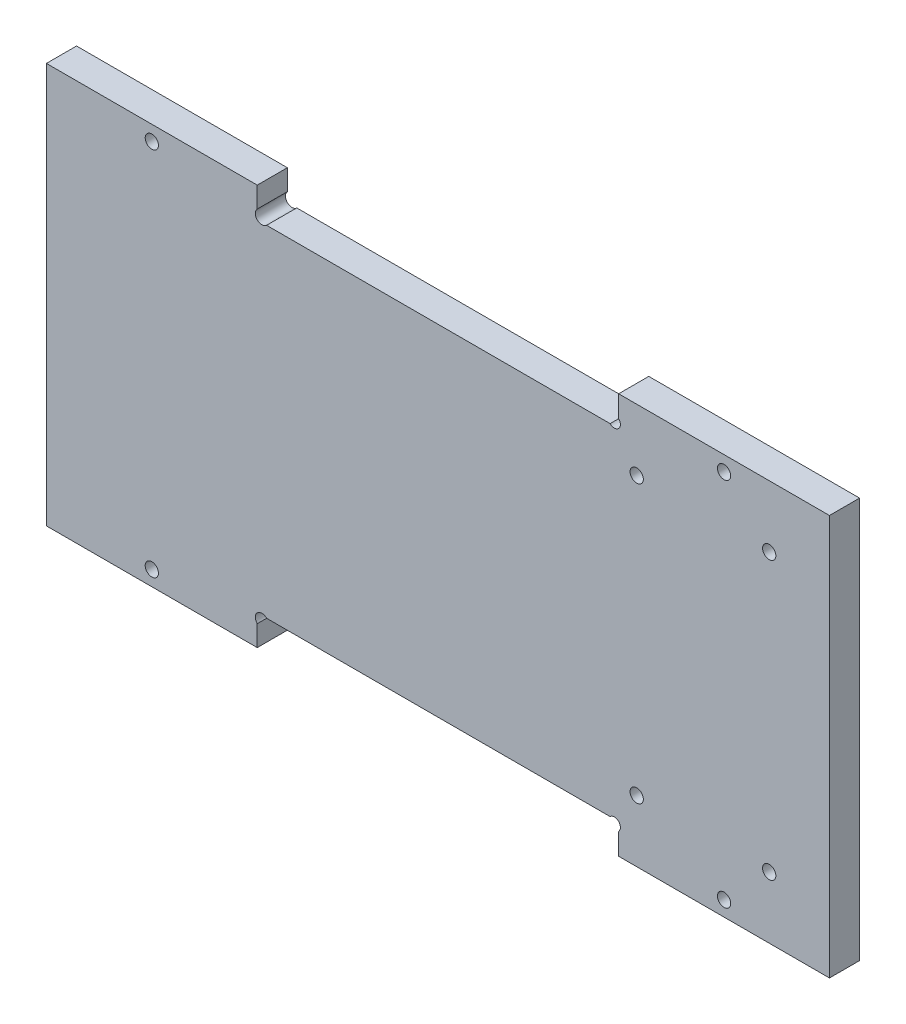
ISO-10303-21;
HEADER;
FILE_DESCRIPTION(('STEP AP214'),'2;1');
FILE_NAME('part.step','',(''),(''),'','','');
FILE_SCHEMA(('AUTOMOTIVE_DESIGN { 1 0 10303 214 1 1 1 1 }'));
ENDSEC;
DATA;
#1=APPLICATION_CONTEXT('core data for automotive mechanical design processes');
#2=APPLICATION_PROTOCOL_DEFINITION('international standard','automotive_design',2000,#1);
#3=PRODUCT_CONTEXT('',#1,'mechanical');
#4=PRODUCT('Part','Part','',(#3));
#5=PRODUCT_RELATED_PRODUCT_CATEGORY('part','',(#4));
#6=PRODUCT_DEFINITION_FORMATION('','',#4);
#7=PRODUCT_DEFINITION_CONTEXT('part definition',#1,'design');
#8=PRODUCT_DEFINITION('design','',#6,#7);
#9=PRODUCT_DEFINITION_SHAPE('','',#8);
#10=(LENGTH_UNIT() NAMED_UNIT(*) SI_UNIT(.MILLI.,.METRE.));
#11=(NAMED_UNIT(*) PLANE_ANGLE_UNIT() SI_UNIT($,.RADIAN.));
#12=(NAMED_UNIT(*) SI_UNIT($,.STERADIAN.) SOLID_ANGLE_UNIT());
#13=UNCERTAINTY_MEASURE_WITH_UNIT(LENGTH_MEASURE(1.E-05),#10,'distance_accuracy_value','');
#14=(GEOMETRIC_REPRESENTATION_CONTEXT(3) GLOBAL_UNCERTAINTY_ASSIGNED_CONTEXT((#13)) GLOBAL_UNIT_ASSIGNED_CONTEXT((#10,
#11,#12)) REPRESENTATION_CONTEXT('',''));
#15=CARTESIAN_POINT('',(0.,0.,0.));
#16=DIRECTION('',(0.,0.,1.));
#17=DIRECTION('',(1.,0.,0.));
#18=AXIS2_PLACEMENT_3D('',#15,#16,#17);
#19=CARTESIAN_POINT('',(0.,66.5,5.));
#20=DIRECTION('',(0.,0.,-1.));
#21=DIRECTION('',(-1.,0.,0.));
#22=AXIS2_PLACEMENT_3D('',#19,#20,#21);
#23=PLANE('',#22);
#24=CARTESIAN_POINT('',(17.5,2.5,5.));
#25=DIRECTION('',(0.,0.,-1.));
#26=DIRECTION('',(-1.,0.,0.));
#27=AXIS2_PLACEMENT_3D('',#24,#25,#26);
#28=CIRCLE('',#27,1.10000000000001);
#29=CARTESIAN_POINT('',(16.4,2.5,5.));
#30=VERTEX_POINT('',#29);
#31=EDGE_CURVE('E352',#30,#30,#28,.T.);
#32=ORIENTED_EDGE('',*,*,#31,.T.);
#33=EDGE_LOOP('',(#32));
#34=FACE_BOUND('',#33,.T.);
#35=CARTESIAN_POINT('',(112.5,2.5,5.));
#36=DIRECTION('',(0.,0.,-1.));
#37=DIRECTION('',(-1.,0.,0.));
#38=AXIS2_PLACEMENT_3D('',#35,#36,#37);
#39=CIRCLE('',#38,1.10000000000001);
#40=CARTESIAN_POINT('',(111.4,2.5,5.));
#41=VERTEX_POINT('',#40);
#42=EDGE_CURVE('E169',#41,#41,#39,.F.);
#43=ORIENTED_EDGE('',*,*,#42,.F.);
#44=EDGE_LOOP('',(#43));
#45=FACE_BOUND('',#44,.T.);
#46=CARTESIAN_POINT('',(120.,56.25,5.));
#47=DIRECTION('',(0.,0.,1.));
#48=DIRECTION('',(1.,0.,0.));
#49=AXIS2_PLACEMENT_3D('',#46,#47,#48);
#50=CIRCLE('',#49,1.09999999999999);
#51=CARTESIAN_POINT('',(121.1,56.25,5.));
#52=VERTEX_POINT('',#51);
#53=EDGE_CURVE('E243',#52,#52,#50,.T.);
#54=ORIENTED_EDGE('',*,*,#53,.F.);
#55=EDGE_LOOP('',(#54));
#56=FACE_BOUND('',#55,.T.);
#57=CARTESIAN_POINT('',(120.,10.25,5.));
#58=DIRECTION('',(0.,0.,1.));
#59=DIRECTION('',(1.,0.,0.));
#60=AXIS2_PLACEMENT_3D('',#57,#58,#59);
#61=CIRCLE('',#60,1.09999999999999);
#62=CARTESIAN_POINT('',(121.1,10.25,5.));
#63=VERTEX_POINT('',#62);
#64=EDGE_CURVE('E237',#63,#63,#61,.T.);
#65=ORIENTED_EDGE('',*,*,#64,.F.);
#66=EDGE_LOOP('',(#65));
#67=FACE_BOUND('',#66,.T.);
#68=CARTESIAN_POINT('',(98.,10.25,5.));
#69=DIRECTION('',(0.,0.,1.));
#70=DIRECTION('',(1.,0.,0.));
#71=AXIS2_PLACEMENT_3D('',#68,#69,#70);
#72=CIRCLE('',#71,1.10000000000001);
#73=CARTESIAN_POINT('',(99.1,10.25,5.));
#74=VERTEX_POINT('',#73);
#75=EDGE_CURVE('E231',#74,#74,#72,.T.);
#76=ORIENTED_EDGE('',*,*,#75,.F.);
#77=EDGE_LOOP('',(#76));
#78=FACE_BOUND('',#77,.T.);
#79=CARTESIAN_POINT('',(98.,56.25,5.));
#80=DIRECTION('',(0.,0.,1.));
#81=DIRECTION('',(1.,0.,0.));
#82=AXIS2_PLACEMENT_3D('',#79,#80,#81);
#83=CIRCLE('',#82,1.10000000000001);
#84=CARTESIAN_POINT('',(99.1,56.25,5.));
#85=VERTEX_POINT('',#84);
#86=EDGE_CURVE('E225',#85,#85,#83,.T.);
#87=ORIENTED_EDGE('',*,*,#86,.F.);
#88=EDGE_LOOP('',(#87));
#89=FACE_BOUND('',#88,.T.);
#90=CARTESIAN_POINT('',(35.7778174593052,62.2778174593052,5.));
#91=DIRECTION('',(0.,0.,-1.));
#92=DIRECTION('',(-1.,0.,0.));
#93=AXIS2_PLACEMENT_3D('',#90,#91,#92);
#94=CIRCLE('',#93,1.1);
#95=CARTESIAN_POINT('',(36.5556349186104,61.5,5.));
#96=VERTEX_POINT('',#95);
#97=CARTESIAN_POINT('',(35.,63.0556349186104,5.));
#98=VERTEX_POINT('',#97);
#99=EDGE_CURVE('E160',#96,#98,#94,.T.);
#100=ORIENTED_EDGE('',*,*,#99,.T.);
#101=DIRECTION('',(0.,1.,0.));
#102=VECTOR('',#101,1.);
#103=CARTESIAN_POINT('',(35.,66.5,5.));
#104=LINE('',#103,#102);
#105=CARTESIAN_POINT('',(35.,66.5,5.));
#106=VERTEX_POINT('',#105);
#107=EDGE_CURVE('E167',#98,#106,#104,.T.);
#108=ORIENTED_EDGE('',*,*,#107,.T.);
#109=DIRECTION('',(-1.,0.,0.));
#110=VECTOR('',#109,1.);
#111=CARTESIAN_POINT('',(0.,66.5,5.));
#112=LINE('',#111,#110);
#113=CARTESIAN_POINT('',(0.,66.5,5.));
#114=VERTEX_POINT('',#113);
#115=EDGE_CURVE('E259',#106,#114,#112,.T.);
#116=ORIENTED_EDGE('',*,*,#115,.T.);
#117=DIRECTION('',(0.,-1.,0.));
#118=VECTOR('',#117,1.);
#119=CARTESIAN_POINT('',(0.,0.,5.));
#120=LINE('',#119,#118);
#121=CARTESIAN_POINT('',(0.,0.,5.));
#122=VERTEX_POINT('',#121);
#123=EDGE_CURVE('E249',#114,#122,#120,.T.);
#124=ORIENTED_EDGE('',*,*,#123,.T.);
#125=DIRECTION('',(1.,0.,0.));
#126=VECTOR('',#125,1.);
#127=CARTESIAN_POINT('',(0.,0.,5.));
#128=LINE('',#127,#126);
#129=CARTESIAN_POINT('',(35.,0.,5.));
#130=VERTEX_POINT('',#129);
#131=EDGE_CURVE('E254',#122,#130,#128,.T.);
#132=ORIENTED_EDGE('',*,*,#131,.T.);
#133=DIRECTION('',(0.,-1.,0.));
#134=VECTOR('',#133,1.);
#135=CARTESIAN_POINT('',(35.,0.,5.));
#136=LINE('',#135,#134);
#137=CARTESIAN_POINT('',(35.,3.44436508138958,5.));
#138=VERTEX_POINT('',#137);
#139=EDGE_CURVE('E207',#138,#130,#136,.T.);
#140=ORIENTED_EDGE('',*,*,#139,.F.);
#141=CARTESIAN_POINT('',(35.7778174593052,4.22218254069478,5.));
#142=DIRECTION('',(0.,0.,-1.));
#143=DIRECTION('',(-1.,0.,0.));
#144=AXIS2_PLACEMENT_3D('',#141,#142,#143);
#145=CIRCLE('',#144,1.1);
#146=CARTESIAN_POINT('',(36.5556349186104,4.99999999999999,5.));
#147=VERTEX_POINT('',#146);
#148=EDGE_CURVE('E197',#147,#138,#145,.F.);
#149=ORIENTED_EDGE('',*,*,#148,.F.);
#150=DIRECTION('',(-1.,0.,0.));
#151=VECTOR('',#150,1.);
#152=CARTESIAN_POINT('',(35.,4.99999999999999,5.));
#153=LINE('',#152,#151);
#154=CARTESIAN_POINT('',(93.5857864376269,4.99999999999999,5.));
#155=VERTEX_POINT('',#154);
#156=EDGE_CURVE('E219',#155,#147,#153,.T.);
#157=ORIENTED_EDGE('',*,*,#156,.F.);
#158=CARTESIAN_POINT('',(94.2928932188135,4.29289321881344,5.));
#159=DIRECTION('',(0.,0.,-1.));
#160=DIRECTION('',(-1.,0.,0.));
#161=AXIS2_PLACEMENT_3D('',#158,#159,#160);
#162=CIRCLE('',#161,0.999999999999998);
#163=CARTESIAN_POINT('',(95.,3.5857864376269,5.));
#164=VERTEX_POINT('',#163);
#165=EDGE_CURVE('E56',#164,#155,#162,.F.);
#166=ORIENTED_EDGE('',*,*,#165,.F.);
#167=DIRECTION('',(0.,1.,0.));
#168=VECTOR('',#167,1.);
#169=CARTESIAN_POINT('',(95.,0.,5.));
#170=LINE('',#169,#168);
#171=CARTESIAN_POINT('',(95.,0.,5.));
#172=VERTEX_POINT('',#171);
#173=EDGE_CURVE('E204',#172,#164,#170,.T.);
#174=ORIENTED_EDGE('',*,*,#173,.F.);
#175=CARTESIAN_POINT('',(130.,0.,5.));
#176=VERTEX_POINT('',#175);
#177=EDGE_CURVE('E252',#172,#176,#128,.T.);
#178=ORIENTED_EDGE('',*,*,#177,.T.);
#179=DIRECTION('',(0.,1.,0.));
#180=VECTOR('',#179,1.);
#181=CARTESIAN_POINT('',(130.,0.,5.));
#182=LINE('',#181,#180);
#183=CARTESIAN_POINT('',(130.,66.5,5.));
#184=VERTEX_POINT('',#183);
#185=EDGE_CURVE('E257',#176,#184,#182,.T.);
#186=ORIENTED_EDGE('',*,*,#185,.T.);
#187=CARTESIAN_POINT('',(95.,66.5,5.));
#188=VERTEX_POINT('',#187);
#189=EDGE_CURVE('E260',#184,#188,#112,.T.);
#190=ORIENTED_EDGE('',*,*,#189,.T.);
#191=DIRECTION('',(0.,-1.,0.));
#192=VECTOR('',#191,1.);
#193=CARTESIAN_POINT('',(95.,66.5,5.));
#194=LINE('',#193,#192);
#195=CARTESIAN_POINT('',(95.,62.9142135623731,5.));
#196=VERTEX_POINT('',#195);
#197=EDGE_CURVE('E296',#188,#196,#194,.T.);
#198=ORIENTED_EDGE('',*,*,#197,.T.);
#199=CARTESIAN_POINT('',(94.2928932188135,62.2071067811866,5.));
#200=DIRECTION('',(0.,0.,-1.));
#201=DIRECTION('',(-1.,0.,0.));
#202=AXIS2_PLACEMENT_3D('',#199,#200,#201);
#203=CIRCLE('',#202,0.999999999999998);
#204=CARTESIAN_POINT('',(93.5857864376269,61.5,5.));
#205=VERTEX_POINT('',#204);
#206=EDGE_CURVE('E335',#196,#205,#203,.T.);
#207=ORIENTED_EDGE('',*,*,#206,.T.);
#208=DIRECTION('',(-1.,0.,0.));
#209=VECTOR('',#208,1.);
#210=CARTESIAN_POINT('',(35.,61.5,5.));
#211=LINE('',#210,#209);
#212=EDGE_CURVE('E179',#205,#96,#211,.T.);
#213=ORIENTED_EDGE('',*,*,#212,.T.);
#214=EDGE_LOOP('',(#100,#108,#116,#124,#132,#140,#149,#157,#166,#174,#178,#186,#190,#198,#207,#213));
#215=FACE_BOUND('',#214,.T.);
#216=CARTESIAN_POINT('',(17.5,64.,5.));
#217=DIRECTION('',(0.,0.,-1.));
#218=DIRECTION('',(-1.,0.,0.));
#219=AXIS2_PLACEMENT_3D('',#216,#217,#218);
#220=CIRCLE('',#219,1.10000000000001);
#221=CARTESIAN_POINT('',(16.4,64.,5.));
#222=VERTEX_POINT('',#221);
#223=EDGE_CURVE('E355',#222,#222,#220,.F.);
#224=ORIENTED_EDGE('',*,*,#223,.F.);
#225=EDGE_LOOP('',(#224));
#226=FACE_BOUND('',#225,.T.);
#227=CARTESIAN_POINT('',(112.5,64.,5.));
#228=DIRECTION('',(0.,0.,-1.));
#229=DIRECTION('',(-1.,0.,0.));
#230=AXIS2_PLACEMENT_3D('',#227,#228,#229);
#231=CIRCLE('',#230,1.10000000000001);
#232=CARTESIAN_POINT('',(111.4,64.,5.));
#233=VERTEX_POINT('',#232);
#234=EDGE_CURVE('E364',#233,#233,#231,.T.);
#235=ORIENTED_EDGE('',*,*,#234,.T.);
#236=EDGE_LOOP('',(#235));
#237=FACE_BOUND('',#236,.T.);
#238=ADVANCED_FACE('F33',(#34,#45,#56,#67,#78,#89,#215,#226,#237),#23,.F.);
#239=CARTESIAN_POINT('',(0.,66.5,0.));
#240=DIRECTION('',(0.,0.,-1.));
#241=DIRECTION('',(-1.,0.,0.));
#242=AXIS2_PLACEMENT_3D('',#239,#240,#241);
#243=PLANE('',#242);
#244=CARTESIAN_POINT('',(17.5,2.5,0.));
#245=DIRECTION('',(0.,0.,1.));
#246=DIRECTION('',(1.,0.,0.));
#247=AXIS2_PLACEMENT_3D('',#244,#245,#246);
#248=CIRCLE('',#247,1.10000000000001);
#249=CARTESIAN_POINT('',(18.6,2.5,0.));
#250=VERTEX_POINT('',#249);
#251=EDGE_CURVE('E351',#250,#250,#248,.T.);
#252=ORIENTED_EDGE('',*,*,#251,.T.);
#253=EDGE_LOOP('',(#252));
#254=FACE_BOUND('',#253,.T.);
#255=CARTESIAN_POINT('',(112.5,2.5,0.));
#256=DIRECTION('',(0.,0.,-1.));
#257=DIRECTION('',(-1.,0.,0.));
#258=AXIS2_PLACEMENT_3D('',#255,#256,#257);
#259=CIRCLE('',#258,1.10000000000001);
#260=CARTESIAN_POINT('',(111.4,2.5,0.));
#261=VERTEX_POINT('',#260);
#262=EDGE_CURVE('E348',#261,#261,#259,.T.);
#263=ORIENTED_EDGE('',*,*,#262,.F.);
#264=EDGE_LOOP('',(#263));
#265=FACE_BOUND('',#264,.T.);
#266=CARTESIAN_POINT('',(120.,56.25,0.));
#267=DIRECTION('',(0.,0.,-1.));
#268=DIRECTION('',(-1.,0.,0.));
#269=AXIS2_PLACEMENT_3D('',#266,#267,#268);
#270=CIRCLE('',#269,1.09999999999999);
#271=CARTESIAN_POINT('',(118.9,56.25,0.));
#272=VERTEX_POINT('',#271);
#273=EDGE_CURVE('E240',#272,#272,#270,.F.);
#274=ORIENTED_EDGE('',*,*,#273,.T.);
#275=EDGE_LOOP('',(#274));
#276=FACE_BOUND('',#275,.T.);
#277=CARTESIAN_POINT('',(120.,10.25,0.));
#278=DIRECTION('',(0.,0.,-1.));
#279=DIRECTION('',(-1.,0.,0.));
#280=AXIS2_PLACEMENT_3D('',#277,#278,#279);
#281=CIRCLE('',#280,1.09999999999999);
#282=CARTESIAN_POINT('',(118.9,10.25,0.));
#283=VERTEX_POINT('',#282);
#284=EDGE_CURVE('E234',#283,#283,#281,.F.);
#285=ORIENTED_EDGE('',*,*,#284,.T.);
#286=EDGE_LOOP('',(#285));
#287=FACE_BOUND('',#286,.T.);
#288=CARTESIAN_POINT('',(98.,10.25,0.));
#289=DIRECTION('',(0.,0.,-1.));
#290=DIRECTION('',(-1.,0.,0.));
#291=AXIS2_PLACEMENT_3D('',#288,#289,#290);
#292=CIRCLE('',#291,1.10000000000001);
#293=CARTESIAN_POINT('',(96.9,10.25,0.));
#294=VERTEX_POINT('',#293);
#295=EDGE_CURVE('E228',#294,#294,#292,.F.);
#296=ORIENTED_EDGE('',*,*,#295,.T.);
#297=EDGE_LOOP('',(#296));
#298=FACE_BOUND('',#297,.T.);
#299=CARTESIAN_POINT('',(98.,56.25,0.));
#300=DIRECTION('',(0.,0.,-1.));
#301=DIRECTION('',(-1.,0.,0.));
#302=AXIS2_PLACEMENT_3D('',#299,#300,#301);
#303=CIRCLE('',#302,1.10000000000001);
#304=CARTESIAN_POINT('',(96.9,56.25,0.));
#305=VERTEX_POINT('',#304);
#306=EDGE_CURVE('E224',#305,#305,#303,.F.);
#307=ORIENTED_EDGE('',*,*,#306,.T.);
#308=EDGE_LOOP('',(#307));
#309=FACE_BOUND('',#308,.T.);
#310=DIRECTION('',(0.,-1.,0.));
#311=VECTOR('',#310,1.);
#312=CARTESIAN_POINT('',(35.,66.5,0.));
#313=LINE('',#312,#311);
#314=CARTESIAN_POINT('',(35.,66.5,0.));
#315=VERTEX_POINT('',#314);
#316=CARTESIAN_POINT('',(35.,63.0556349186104,0.));
#317=VERTEX_POINT('',#316);
#318=EDGE_CURVE('E165',#315,#317,#313,.T.);
#319=ORIENTED_EDGE('',*,*,#318,.T.);
#320=CARTESIAN_POINT('',(35.7778174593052,62.2778174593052,0.));
#321=DIRECTION('',(0.,0.,1.));
#322=DIRECTION('',(-1.,0.,0.));
#323=AXIS2_PLACEMENT_3D('',#320,#321,#322);
#324=CIRCLE('',#323,1.1);
#325=CARTESIAN_POINT('',(36.5556349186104,61.5,0.));
#326=VERTEX_POINT('',#325);
#327=EDGE_CURVE('E149',#317,#326,#324,.T.);
#328=ORIENTED_EDGE('',*,*,#327,.T.);
#329=DIRECTION('',(1.,0.,0.));
#330=VECTOR('',#329,1.);
#331=CARTESIAN_POINT('',(35.,61.5,0.));
#332=LINE('',#331,#330);
#333=CARTESIAN_POINT('',(93.5857864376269,61.5,0.));
#334=VERTEX_POINT('',#333);
#335=EDGE_CURVE('E177',#326,#334,#332,.T.);
#336=ORIENTED_EDGE('',*,*,#335,.T.);
#337=CARTESIAN_POINT('',(94.2928932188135,62.2071067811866,0.));
#338=DIRECTION('',(0.,0.,1.));
#339=DIRECTION('',(-1.,0.,0.));
#340=AXIS2_PLACEMENT_3D('',#337,#338,#339);
#341=CIRCLE('',#340,0.999999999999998);
#342=CARTESIAN_POINT('',(95.,62.9142135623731,0.));
#343=VERTEX_POINT('',#342);
#344=EDGE_CURVE('E330',#334,#343,#341,.T.);
#345=ORIENTED_EDGE('',*,*,#344,.T.);
#346=DIRECTION('',(0.,1.,0.));
#347=VECTOR('',#346,1.);
#348=CARTESIAN_POINT('',(95.,66.5,0.));
#349=LINE('',#348,#347);
#350=CARTESIAN_POINT('',(95.,66.5,0.));
#351=VERTEX_POINT('',#350);
#352=EDGE_CURVE('E48',#343,#351,#349,.T.);
#353=ORIENTED_EDGE('',*,*,#352,.T.);
#354=DIRECTION('',(-1.,0.,0.));
#355=VECTOR('',#354,1.);
#356=CARTESIAN_POINT('',(0.,66.5,0.));
#357=LINE('',#356,#355);
#358=CARTESIAN_POINT('',(130.,66.5,0.));
#359=VERTEX_POINT('',#358);
#360=EDGE_CURVE('E253',#359,#351,#357,.T.);
#361=ORIENTED_EDGE('',*,*,#360,.F.);
#362=DIRECTION('',(0.,1.,0.));
#363=VECTOR('',#362,1.);
#364=CARTESIAN_POINT('',(130.,0.,0.));
#365=LINE('',#364,#363);
#366=CARTESIAN_POINT('',(130.,0.,0.));
#367=VERTEX_POINT('',#366);
#368=EDGE_CURVE('E270',#367,#359,#365,.T.);
#369=ORIENTED_EDGE('',*,*,#368,.F.);
#370=DIRECTION('',(1.,0.,0.));
#371=VECTOR('',#370,1.);
#372=CARTESIAN_POINT('',(0.,0.,0.));
#373=LINE('',#372,#371);
#374=CARTESIAN_POINT('',(95.,0.,0.));
#375=VERTEX_POINT('',#374);
#376=EDGE_CURVE('E266',#375,#367,#373,.T.);
#377=ORIENTED_EDGE('',*,*,#376,.F.);
#378=DIRECTION('',(0.,-1.,0.));
#379=VECTOR('',#378,1.);
#380=CARTESIAN_POINT('',(95.,0.,0.));
#381=LINE('',#380,#379);
#382=CARTESIAN_POINT('',(95.,3.5857864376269,0.));
#383=VERTEX_POINT('',#382);
#384=EDGE_CURVE('E214',#383,#375,#381,.T.);
#385=ORIENTED_EDGE('',*,*,#384,.F.);
#386=CARTESIAN_POINT('',(94.2928932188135,4.29289321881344,0.));
#387=DIRECTION('',(0.,0.,-1.));
#388=DIRECTION('',(-1.,0.,0.));
#389=AXIS2_PLACEMENT_3D('',#386,#387,#388);
#390=CIRCLE('',#389,0.999999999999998);
#391=CARTESIAN_POINT('',(93.5857864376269,4.99999999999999,0.));
#392=VERTEX_POINT('',#391);
#393=EDGE_CURVE('E201',#392,#383,#390,.T.);
#394=ORIENTED_EDGE('',*,*,#393,.F.);
#395=DIRECTION('',(1.,0.,0.));
#396=VECTOR('',#395,1.);
#397=CARTESIAN_POINT('',(35.,4.99999999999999,0.));
#398=LINE('',#397,#396);
#399=CARTESIAN_POINT('',(36.5556349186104,4.99999999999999,0.));
#400=VERTEX_POINT('',#399);
#401=EDGE_CURVE('E212',#400,#392,#398,.T.);
#402=ORIENTED_EDGE('',*,*,#401,.F.);
#403=CARTESIAN_POINT('',(35.7778174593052,4.22218254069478,0.));
#404=DIRECTION('',(0.,0.,-1.));
#405=DIRECTION('',(-1.,0.,0.));
#406=AXIS2_PLACEMENT_3D('',#403,#404,#405);
#407=CIRCLE('',#406,1.1);
#408=CARTESIAN_POINT('',(35.,3.44436508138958,0.));
#409=VERTEX_POINT('',#408);
#410=EDGE_CURVE('E195',#409,#400,#407,.T.);
#411=ORIENTED_EDGE('',*,*,#410,.F.);
#412=DIRECTION('',(0.,1.,0.));
#413=VECTOR('',#412,1.);
#414=CARTESIAN_POINT('',(35.,0.,0.));
#415=LINE('',#414,#413);
#416=CARTESIAN_POINT('',(35.,0.,0.));
#417=VERTEX_POINT('',#416);
#418=EDGE_CURVE('E209',#417,#409,#415,.T.);
#419=ORIENTED_EDGE('',*,*,#418,.F.);
#420=CARTESIAN_POINT('',(0.,0.,0.));
#421=VERTEX_POINT('',#420);
#422=EDGE_CURVE('E267',#421,#417,#373,.T.);
#423=ORIENTED_EDGE('',*,*,#422,.F.);
#424=DIRECTION('',(0.,-1.,0.));
#425=VECTOR('',#424,1.);
#426=CARTESIAN_POINT('',(0.,0.,0.));
#427=LINE('',#426,#425);
#428=CARTESIAN_POINT('',(0.,66.5,0.));
#429=VERTEX_POINT('',#428);
#430=EDGE_CURVE('E246',#429,#421,#427,.T.);
#431=ORIENTED_EDGE('',*,*,#430,.F.);
#432=EDGE_CURVE('E175',#315,#429,#357,.T.);
#433=ORIENTED_EDGE('',*,*,#432,.F.);
#434=EDGE_LOOP('',(#319,#328,#336,#345,#353,#361,#369,#377,#385,#394,#402,#411,#419,#423,#431,#433));
#435=FACE_BOUND('',#434,.T.);
#436=CARTESIAN_POINT('',(17.5,64.,0.));
#437=DIRECTION('',(0.,0.,-1.));
#438=DIRECTION('',(1.,0.,0.));
#439=AXIS2_PLACEMENT_3D('',#436,#437,#438);
#440=CIRCLE('',#439,1.10000000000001);
#441=CARTESIAN_POINT('',(18.6,64.,0.));
#442=VERTEX_POINT('',#441);
#443=EDGE_CURVE('E360',#442,#442,#440,.T.);
#444=ORIENTED_EDGE('',*,*,#443,.F.);
#445=EDGE_LOOP('',(#444));
#446=FACE_BOUND('',#445,.T.);
#447=CARTESIAN_POINT('',(112.5,64.,0.));
#448=DIRECTION('',(0.,0.,1.));
#449=DIRECTION('',(-1.,0.,0.));
#450=AXIS2_PLACEMENT_3D('',#447,#448,#449);
#451=CIRCLE('',#450,1.10000000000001);
#452=CARTESIAN_POINT('',(111.4,64.,0.));
#453=VERTEX_POINT('',#452);
#454=EDGE_CURVE('E363',#453,#453,#451,.T.);
#455=ORIENTED_EDGE('',*,*,#454,.T.);
#456=EDGE_LOOP('',(#455));
#457=FACE_BOUND('',#456,.T.);
#458=ADVANCED_FACE('F172',(#254,#265,#276,#287,#298,#309,#435,#446,#457),#243,.T.);
#459=CARTESIAN_POINT('',(35.,66.5,5.001));
#460=DIRECTION('',(1.,0.,0.));
#461=DIRECTION('',(0.,0.,-1.));
#462=AXIS2_PLACEMENT_3D('',#459,#460,#461);
#463=PLANE('',#462);
#464=ORIENTED_EDGE('',*,*,#107,.F.);
#465=DIRECTION('',(0.,0.,-1.));
#466=VECTOR('',#465,1.);
#467=CARTESIAN_POINT('',(35.,63.0556349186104,5.001));
#468=LINE('',#467,#466);
#469=EDGE_CURVE('E153',#317,#98,#468,.F.);
#470=ORIENTED_EDGE('',*,*,#469,.F.);
#471=ORIENTED_EDGE('',*,*,#318,.F.);
#472=DIRECTION('',(0.,0.,-1.));
#473=VECTOR('',#472,1.);
#474=CARTESIAN_POINT('',(35.,66.5,5.001));
#475=LINE('',#474,#473);
#476=EDGE_CURVE('E184',#106,#315,#475,.T.);
#477=ORIENTED_EDGE('',*,*,#476,.F.);
#478=EDGE_LOOP('',(#464,#470,#471,#477));
#479=FACE_BOUND('',#478,.T.);
#480=ADVANCED_FACE('F163',(#479),#463,.T.);
#481=CARTESIAN_POINT('',(35.,61.5,5.001));
#482=DIRECTION('',(0.,1.,0.));
#483=DIRECTION('',(0.,0.,1.));
#484=AXIS2_PLACEMENT_3D('',#481,#482,#483);
#485=PLANE('',#484);
#486=ORIENTED_EDGE('',*,*,#212,.F.);
#487=DIRECTION('',(0.,0.,-1.));
#488=VECTOR('',#487,1.);
#489=CARTESIAN_POINT('',(93.5857864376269,61.5,5.001));
#490=LINE('',#489,#488);
#491=EDGE_CURVE('E168',#334,#205,#490,.F.);
#492=ORIENTED_EDGE('',*,*,#491,.F.);
#493=ORIENTED_EDGE('',*,*,#335,.F.);
#494=DIRECTION('',(0.,0.,-1.));
#495=VECTOR('',#494,1.);
#496=CARTESIAN_POINT('',(36.5556349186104,61.5,5.001));
#497=LINE('',#496,#495);
#498=EDGE_CURVE('E156',#96,#326,#497,.T.);
#499=ORIENTED_EDGE('',*,*,#498,.F.);
#500=EDGE_LOOP('',(#486,#492,#493,#499));
#501=FACE_BOUND('',#500,.T.);
#502=ADVANCED_FACE('F344',(#501),#485,.T.);
#503=CARTESIAN_POINT('',(95.,66.5,5.001));
#504=DIRECTION('',(-1.,0.,0.));
#505=DIRECTION('',(0.,0.,1.));
#506=AXIS2_PLACEMENT_3D('',#503,#504,#505);
#507=PLANE('',#506);
#508=ORIENTED_EDGE('',*,*,#352,.F.);
#509=DIRECTION('',(0.,0.,-1.));
#510=VECTOR('',#509,1.);
#511=CARTESIAN_POINT('',(95.,62.9142135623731,5.001));
#512=LINE('',#511,#510);
#513=EDGE_CURVE('E328',#196,#343,#512,.T.);
#514=ORIENTED_EDGE('',*,*,#513,.F.);
#515=ORIENTED_EDGE('',*,*,#197,.F.);
#516=DIRECTION('',(0.,0.,-1.));
#517=VECTOR('',#516,1.);
#518=CARTESIAN_POINT('',(95.,66.5,5.001));
#519=LINE('',#518,#517);
#520=EDGE_CURVE('E185',#188,#351,#519,.T.);
#521=ORIENTED_EDGE('',*,*,#520,.T.);
#522=EDGE_LOOP('',(#508,#514,#515,#521));
#523=FACE_BOUND('',#522,.T.);
#524=ADVANCED_FACE('F393',(#523),#507,.T.);
#525=CARTESIAN_POINT('',(0.,66.5,5.));
#526=DIRECTION('',(0.,-1.,0.));
#527=DIRECTION('',(0.,0.,-1.));
#528=AXIS2_PLACEMENT_3D('',#525,#526,#527);
#529=PLANE('',#528);
#530=ORIENTED_EDGE('',*,*,#476,.T.);
#531=ORIENTED_EDGE('',*,*,#432,.T.);
#532=DIRECTION('',(0.,0.,-1.));
#533=VECTOR('',#532,1.);
#534=CARTESIAN_POINT('',(0.,66.5,5.));
#535=LINE('',#534,#533);
#536=EDGE_CURVE('E263',#114,#429,#535,.T.);
#537=ORIENTED_EDGE('',*,*,#536,.F.);
#538=ORIENTED_EDGE('',*,*,#115,.F.);
#539=EDGE_LOOP('',(#530,#531,#537,#538));
#540=FACE_BOUND('',#539,.T.);
#541=ADVANCED_FACE('F326',(#540),#529,.F.);
#542=ORIENTED_EDGE('',*,*,#520,.F.);
#543=ORIENTED_EDGE('',*,*,#189,.F.);
#544=DIRECTION('',(0.,0.,-1.));
#545=VECTOR('',#544,1.);
#546=CARTESIAN_POINT('',(130.,66.5,5.));
#547=LINE('',#546,#545);
#548=EDGE_CURVE('E276',#184,#359,#547,.T.);
#549=ORIENTED_EDGE('',*,*,#548,.T.);
#550=ORIENTED_EDGE('',*,*,#360,.T.);
#551=EDGE_LOOP('',(#542,#543,#549,#550));
#552=FACE_BOUND('',#551,.T.);
#553=ADVANCED_FACE('F291',(#552),#529,.F.);
#554=CARTESIAN_POINT('',(0.,0.,5.));
#555=DIRECTION('',(0.,1.,0.));
#556=DIRECTION('',(0.,0.,1.));
#557=AXIS2_PLACEMENT_3D('',#554,#555,#556);
#558=PLANE('',#557);
#559=ORIENTED_EDGE('',*,*,#422,.T.);
#560=DIRECTION('',(0.,0.,-1.));
#561=VECTOR('',#560,1.);
#562=CARTESIAN_POINT('',(35.,0.,5.001));
#563=LINE('',#562,#561);
#564=EDGE_CURVE('E217',#130,#417,#563,.T.);
#565=ORIENTED_EDGE('',*,*,#564,.F.);
#566=ORIENTED_EDGE('',*,*,#131,.F.);
#567=DIRECTION('',(0.,0.,-1.));
#568=VECTOR('',#567,1.);
#569=CARTESIAN_POINT('',(0.,0.,5.));
#570=LINE('',#569,#568);
#571=EDGE_CURVE('E11',#122,#421,#570,.T.);
#572=ORIENTED_EDGE('',*,*,#571,.T.);
#573=EDGE_LOOP('',(#559,#565,#566,#572));
#574=FACE_BOUND('',#573,.T.);
#575=ADVANCED_FACE('F319',(#574),#558,.F.);
#576=CARTESIAN_POINT('',(0.,0.,5.));
#577=DIRECTION('',(1.,0.,0.));
#578=DIRECTION('',(0.,0.,-1.));
#579=AXIS2_PLACEMENT_3D('',#576,#577,#578);
#580=PLANE('',#579);
#581=ORIENTED_EDGE('',*,*,#430,.T.);
#582=ORIENTED_EDGE('',*,*,#571,.F.);
#583=ORIENTED_EDGE('',*,*,#123,.F.);
#584=ORIENTED_EDGE('',*,*,#536,.T.);
#585=EDGE_LOOP('',(#581,#582,#583,#584));
#586=FACE_BOUND('',#585,.T.);
#587=ADVANCED_FACE('F35',(#586),#580,.F.);
#588=ORIENTED_EDGE('',*,*,#177,.F.);
#589=DIRECTION('',(0.,0.,-1.));
#590=VECTOR('',#589,1.);
#591=CARTESIAN_POINT('',(95.,0.,5.001));
#592=LINE('',#591,#590);
#593=EDGE_CURVE('E216',#172,#375,#592,.T.);
#594=ORIENTED_EDGE('',*,*,#593,.T.);
#595=ORIENTED_EDGE('',*,*,#376,.T.);
#596=DIRECTION('',(0.,0.,-1.));
#597=VECTOR('',#596,1.);
#598=CARTESIAN_POINT('',(130.,0.,5.));
#599=LINE('',#598,#597);
#600=EDGE_CURVE('E41',#176,#367,#599,.T.);
#601=ORIENTED_EDGE('',*,*,#600,.F.);
#602=EDGE_LOOP('',(#588,#594,#595,#601));
#603=FACE_BOUND('',#602,.T.);
#604=ADVANCED_FACE('F298',(#603),#558,.F.);
#605=CARTESIAN_POINT('',(130.,0.,5.));
#606=DIRECTION('',(-1.,0.,0.));
#607=DIRECTION('',(0.,0.,1.));
#608=AXIS2_PLACEMENT_3D('',#605,#606,#607);
#609=PLANE('',#608);
#610=ORIENTED_EDGE('',*,*,#368,.T.);
#611=ORIENTED_EDGE('',*,*,#548,.F.);
#612=ORIENTED_EDGE('',*,*,#185,.F.);
#613=ORIENTED_EDGE('',*,*,#600,.T.);
#614=EDGE_LOOP('',(#610,#611,#612,#613));
#615=FACE_BOUND('',#614,.T.);
#616=ADVANCED_FACE('F283',(#615),#609,.F.);
#617=CARTESIAN_POINT('',(120.,56.25,-0.00100000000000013));
#618=DIRECTION('',(0.,0.,1.));
#619=DIRECTION('',(1.,0.,0.));
#620=AXIS2_PLACEMENT_3D('',#617,#618,#619);
#621=CYLINDRICAL_SURFACE('',#620,1.09999999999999);
#622=ORIENTED_EDGE('',*,*,#273,.F.);
#623=EDGE_LOOP('',(#622));
#624=FACE_BOUND('',#623,.T.);
#625=ORIENTED_EDGE('',*,*,#53,.T.);
#626=EDGE_LOOP('',(#625));
#627=FACE_BOUND('',#626,.T.);
#628=ADVANCED_FACE('F388',(#624,#627),#621,.F.);
#629=CARTESIAN_POINT('',(120.,10.25,-0.00100000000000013));
#630=DIRECTION('',(0.,0.,1.));
#631=DIRECTION('',(1.,0.,0.));
#632=AXIS2_PLACEMENT_3D('',#629,#630,#631);
#633=CYLINDRICAL_SURFACE('',#632,1.09999999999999);
#634=ORIENTED_EDGE('',*,*,#284,.F.);
#635=EDGE_LOOP('',(#634));
#636=FACE_BOUND('',#635,.T.);
#637=ORIENTED_EDGE('',*,*,#64,.T.);
#638=EDGE_LOOP('',(#637));
#639=FACE_BOUND('',#638,.T.);
#640=ADVANCED_FACE('F524',(#636,#639),#633,.F.);
#641=CARTESIAN_POINT('',(98.,10.25,-0.00100000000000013));
#642=DIRECTION('',(0.,0.,1.));
#643=DIRECTION('',(1.,0.,0.));
#644=AXIS2_PLACEMENT_3D('',#641,#642,#643);
#645=CYLINDRICAL_SURFACE('',#644,1.10000000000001);
#646=ORIENTED_EDGE('',*,*,#295,.F.);
#647=EDGE_LOOP('',(#646));
#648=FACE_BOUND('',#647,.T.);
#649=ORIENTED_EDGE('',*,*,#75,.T.);
#650=EDGE_LOOP('',(#649));
#651=FACE_BOUND('',#650,.T.);
#652=ADVANCED_FACE('F516',(#648,#651),#645,.F.);
#653=CARTESIAN_POINT('',(98.,56.25,-0.00100000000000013));
#654=DIRECTION('',(0.,0.,1.));
#655=DIRECTION('',(1.,0.,0.));
#656=AXIS2_PLACEMENT_3D('',#653,#654,#655);
#657=CYLINDRICAL_SURFACE('',#656,1.10000000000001);
#658=ORIENTED_EDGE('',*,*,#306,.F.);
#659=EDGE_LOOP('',(#658));
#660=FACE_BOUND('',#659,.T.);
#661=ORIENTED_EDGE('',*,*,#86,.T.);
#662=EDGE_LOOP('',(#661));
#663=FACE_BOUND('',#662,.T.);
#664=ADVANCED_FACE('F509',(#660,#663),#657,.F.);
#665=CARTESIAN_POINT('',(35.,0.,5.001));
#666=DIRECTION('',(-1.,0.,0.));
#667=DIRECTION('',(0.,0.,1.));
#668=AXIS2_PLACEMENT_3D('',#665,#666,#667);
#669=PLANE('',#668);
#670=ORIENTED_EDGE('',*,*,#418,.T.);
#671=DIRECTION('',(0.,0.,-1.));
#672=VECTOR('',#671,1.);
#673=CARTESIAN_POINT('',(35.,3.44436508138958,5.001));
#674=LINE('',#673,#672);
#675=EDGE_CURVE('E187',#138,#409,#674,.T.);
#676=ORIENTED_EDGE('',*,*,#675,.F.);
#677=ORIENTED_EDGE('',*,*,#139,.T.);
#678=ORIENTED_EDGE('',*,*,#564,.T.);
#679=EDGE_LOOP('',(#670,#676,#677,#678));
#680=FACE_BOUND('',#679,.T.);
#681=ADVANCED_FACE('F315',(#680),#669,.F.);
#682=CARTESIAN_POINT('',(95.,0.,5.001));
#683=DIRECTION('',(1.,0.,0.));
#684=DIRECTION('',(0.,0.,-1.));
#685=AXIS2_PLACEMENT_3D('',#682,#683,#684);
#686=PLANE('',#685);
#687=ORIENTED_EDGE('',*,*,#173,.T.);
#688=DIRECTION('',(0.,0.,-1.));
#689=VECTOR('',#688,1.);
#690=CARTESIAN_POINT('',(95.,3.5857864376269,5.001));
#691=LINE('',#690,#689);
#692=EDGE_CURVE('E191',#383,#164,#691,.F.);
#693=ORIENTED_EDGE('',*,*,#692,.F.);
#694=ORIENTED_EDGE('',*,*,#384,.T.);
#695=ORIENTED_EDGE('',*,*,#593,.F.);
#696=EDGE_LOOP('',(#687,#693,#694,#695));
#697=FACE_BOUND('',#696,.T.);
#698=ADVANCED_FACE('F300',(#697),#686,.F.);
#699=CARTESIAN_POINT('',(35.,4.99999999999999,5.001));
#700=DIRECTION('',(0.,1.,0.));
#701=DIRECTION('',(0.,0.,1.));
#702=AXIS2_PLACEMENT_3D('',#699,#700,#701);
#703=PLANE('',#702);
#704=ORIENTED_EDGE('',*,*,#156,.T.);
#705=DIRECTION('',(0.,0.,-1.));
#706=VECTOR('',#705,1.);
#707=CARTESIAN_POINT('',(36.5556349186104,4.99999999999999,5.001));
#708=LINE('',#707,#706);
#709=EDGE_CURVE('E193',#400,#147,#708,.F.);
#710=ORIENTED_EDGE('',*,*,#709,.F.);
#711=ORIENTED_EDGE('',*,*,#401,.T.);
#712=DIRECTION('',(0.,0.,-1.));
#713=VECTOR('',#712,1.);
#714=CARTESIAN_POINT('',(93.5857864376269,4.99999999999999,5.001));
#715=LINE('',#714,#713);
#716=EDGE_CURVE('E199',#155,#392,#715,.T.);
#717=ORIENTED_EDGE('',*,*,#716,.F.);
#718=EDGE_LOOP('',(#704,#710,#711,#717));
#719=FACE_BOUND('',#718,.T.);
#720=ADVANCED_FACE('F307',(#719),#703,.F.);
#721=CARTESIAN_POINT('',(94.2928932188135,4.29289321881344,5.001));
#722=DIRECTION('',(0.,0.,-1.));
#723=DIRECTION('',(-1.,0.,0.));
#724=AXIS2_PLACEMENT_3D('',#721,#722,#723);
#725=CYLINDRICAL_SURFACE('',#724,0.999999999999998);
#726=ORIENTED_EDGE('',*,*,#393,.T.);
#727=ORIENTED_EDGE('',*,*,#692,.T.);
#728=ORIENTED_EDGE('',*,*,#165,.T.);
#729=ORIENTED_EDGE('',*,*,#716,.T.);
#730=EDGE_LOOP('',(#726,#727,#728,#729));
#731=FACE_BOUND('',#730,.T.);
#732=ADVANCED_FACE('F304',(#731),#725,.F.);
#733=CARTESIAN_POINT('',(35.7778174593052,4.22218254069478,5.001));
#734=DIRECTION('',(0.,0.,-1.));
#735=DIRECTION('',(-1.,0.,0.));
#736=AXIS2_PLACEMENT_3D('',#733,#734,#735);
#737=CYLINDRICAL_SURFACE('',#736,1.1);
#738=ORIENTED_EDGE('',*,*,#148,.T.);
#739=ORIENTED_EDGE('',*,*,#675,.T.);
#740=ORIENTED_EDGE('',*,*,#410,.T.);
#741=ORIENTED_EDGE('',*,*,#709,.T.);
#742=EDGE_LOOP('',(#738,#739,#740,#741));
#743=FACE_BOUND('',#742,.T.);
#744=ADVANCED_FACE('F313',(#743),#737,.F.);
#745=CARTESIAN_POINT('',(94.2928932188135,62.2071067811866,5.001));
#746=DIRECTION('',(0.,0.,-1.));
#747=DIRECTION('',(-1.,0.,0.));
#748=AXIS2_PLACEMENT_3D('',#745,#746,#747);
#749=CYLINDRICAL_SURFACE('',#748,0.999999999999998);
#750=ORIENTED_EDGE('',*,*,#513,.T.);
#751=ORIENTED_EDGE('',*,*,#344,.F.);
#752=ORIENTED_EDGE('',*,*,#491,.T.);
#753=ORIENTED_EDGE('',*,*,#206,.F.);
#754=EDGE_LOOP('',(#750,#751,#752,#753));
#755=FACE_BOUND('',#754,.T.);
#756=ADVANCED_FACE('F341',(#755),#749,.F.);
#757=CARTESIAN_POINT('',(35.7778174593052,62.2778174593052,5.001));
#758=DIRECTION('',(0.,0.,-1.));
#759=DIRECTION('',(-1.,0.,0.));
#760=AXIS2_PLACEMENT_3D('',#757,#758,#759);
#761=CYLINDRICAL_SURFACE('',#760,1.1);
#762=ORIENTED_EDGE('',*,*,#498,.T.);
#763=ORIENTED_EDGE('',*,*,#327,.F.);
#764=ORIENTED_EDGE('',*,*,#469,.T.);
#765=ORIENTED_EDGE('',*,*,#99,.F.);
#766=EDGE_LOOP('',(#762,#763,#764,#765));
#767=FACE_BOUND('',#766,.T.);
#768=ADVANCED_FACE('F151',(#767),#761,.F.);
#769=CARTESIAN_POINT('',(112.5,2.5,5.001));
#770=DIRECTION('',(0.,0.,-1.));
#771=DIRECTION('',(-1.,0.,0.));
#772=AXIS2_PLACEMENT_3D('',#769,#770,#771);
#773=CYLINDRICAL_SURFACE('',#772,1.10000000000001);
#774=ORIENTED_EDGE('',*,*,#262,.T.);
#775=EDGE_LOOP('',(#774));
#776=FACE_BOUND('',#775,.T.);
#777=ORIENTED_EDGE('',*,*,#42,.T.);
#778=EDGE_LOOP('',(#777));
#779=FACE_BOUND('',#778,.T.);
#780=ADVANCED_FACE('F461',(#776,#779),#773,.F.);
#781=CARTESIAN_POINT('',(17.5,2.5,5.001));
#782=DIRECTION('',(0.,0.,-1.));
#783=DIRECTION('',(-1.,0.,0.));
#784=AXIS2_PLACEMENT_3D('',#781,#782,#783);
#785=CYLINDRICAL_SURFACE('',#784,1.10000000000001);
#786=ORIENTED_EDGE('',*,*,#251,.F.);
#787=EDGE_LOOP('',(#786));
#788=FACE_BOUND('',#787,.T.);
#789=ORIENTED_EDGE('',*,*,#31,.F.);
#790=EDGE_LOOP('',(#789));
#791=FACE_BOUND('',#790,.T.);
#792=ADVANCED_FACE('F447',(#788,#791),#785,.F.);
#793=CARTESIAN_POINT('',(17.5,64.,5.001));
#794=DIRECTION('',(0.,0.,-1.));
#795=DIRECTION('',(-1.,0.,0.));
#796=AXIS2_PLACEMENT_3D('',#793,#794,#795);
#797=CYLINDRICAL_SURFACE('',#796,1.10000000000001);
#798=ORIENTED_EDGE('',*,*,#443,.T.);
#799=EDGE_LOOP('',(#798));
#800=FACE_BOUND('',#799,.T.);
#801=ORIENTED_EDGE('',*,*,#223,.T.);
#802=EDGE_LOOP('',(#801));
#803=FACE_BOUND('',#802,.T.);
#804=ADVANCED_FACE('F374',(#800,#803),#797,.F.);
#805=CARTESIAN_POINT('',(112.5,64.,5.001));
#806=DIRECTION('',(0.,0.,-1.));
#807=DIRECTION('',(-1.,0.,0.));
#808=AXIS2_PLACEMENT_3D('',#805,#806,#807);
#809=CYLINDRICAL_SURFACE('',#808,1.10000000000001);
#810=ORIENTED_EDGE('',*,*,#454,.F.);
#811=EDGE_LOOP('',(#810));
#812=FACE_BOUND('',#811,.T.);
#813=ORIENTED_EDGE('',*,*,#234,.F.);
#814=EDGE_LOOP('',(#813));
#815=FACE_BOUND('',#814,.T.);
#816=ADVANCED_FACE('F371',(#812,#815),#809,.F.);
#817=CLOSED_SHELL('',(#238,#458,#480,#502,#524,#541,#553,#575,#587,#604,#616,#628,#640,#652,
#664,#681,#698,#720,#732,#744,#756,#768,#780,#792,#804,#816));
#818=MANIFOLD_SOLID_BREP('B2',#817);
#819=ADVANCED_BREP_SHAPE_REPRESENTATION('',(#18,#818),#14);
#820=SHAPE_DEFINITION_REPRESENTATION(#9,#819);
ENDSEC;
END-ISO-10303-21;
